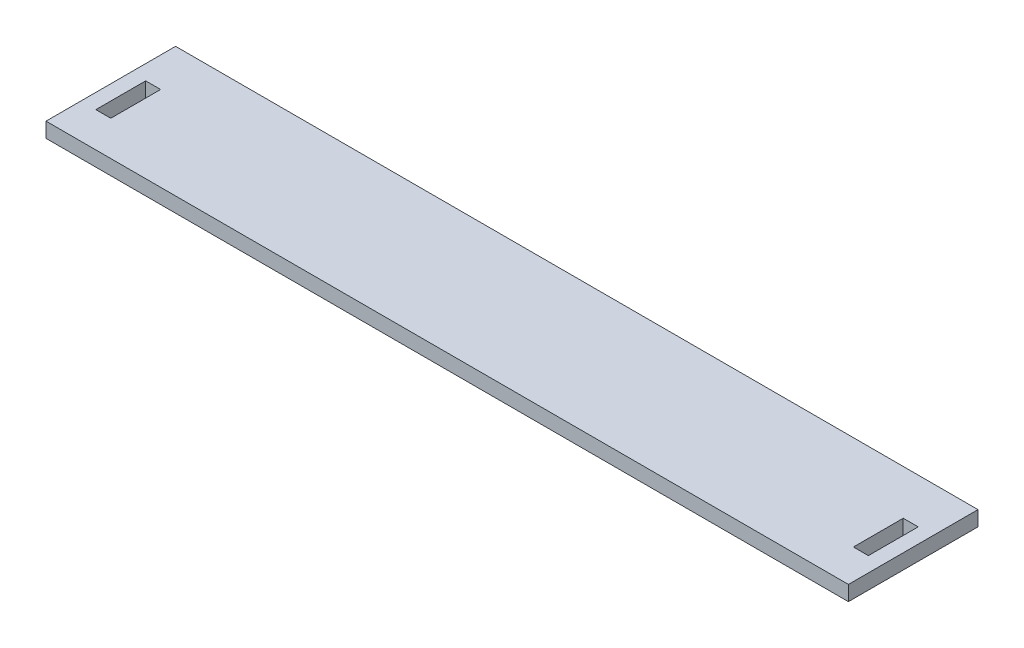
from build123d import *

# Parameters (mm, degrees)
SKETCH1_W           = 161
SKETCH1_H           = 26
SKETCH1_W_2         = 3
SKETCH1_H_2         = 10
BOSS_EXTRUDE1_DEPTH = 3


with BuildPart() as part:
    # Sketch1 → Boss-Extrude1 (new body)
    with BuildSketch(Plane(origin=(0, 0, 0), x_dir=(1, 0, 0), z_dir=(0, 1, 0))):
        Rectangle(SKETCH1_W, SKETCH1_H)
        with Locations((-76, -1)):
            Rectangle(SKETCH1_W_2, SKETCH1_H_2, mode=Mode.SUBTRACT)
        with Locations((76, -1)):
            Rectangle(SKETCH1_W_2, SKETCH1_H_2, mode=Mode.SUBTRACT)
    extrude(amount=BOSS_EXTRUDE1_DEPTH)


solid = part.part
